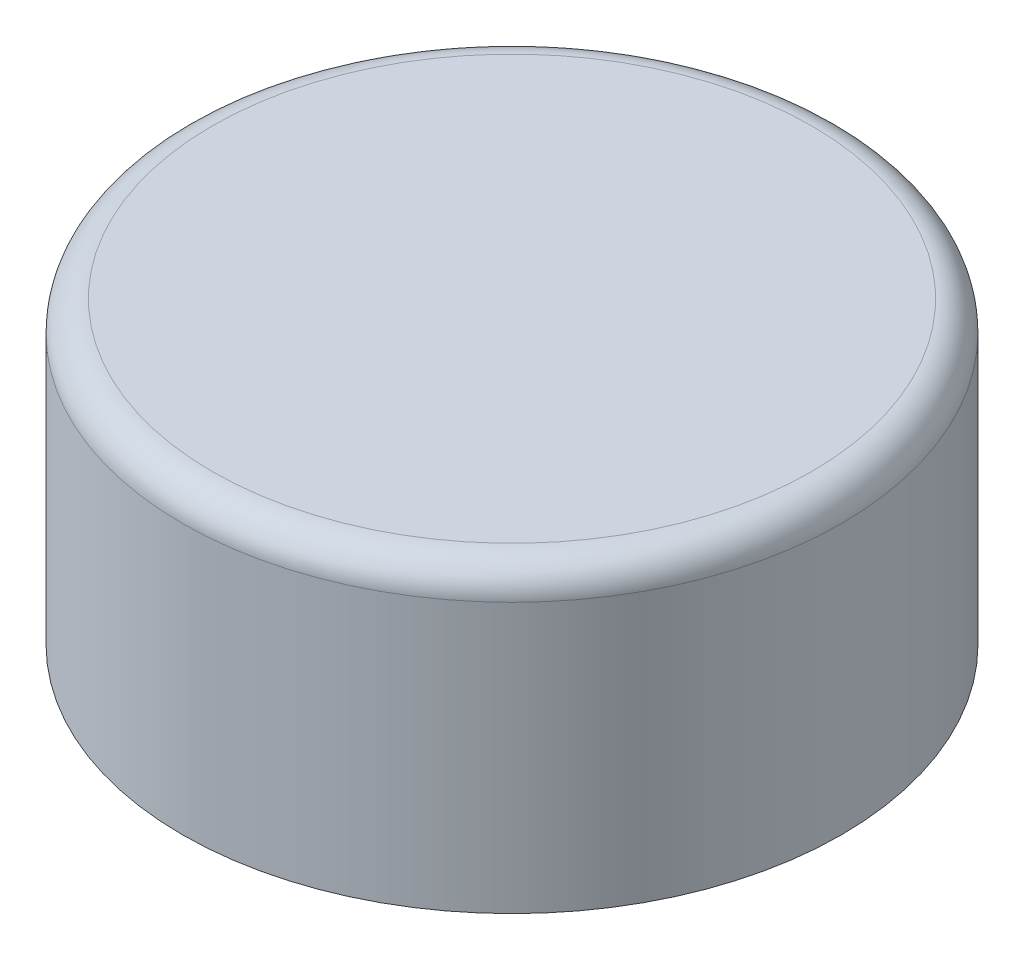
ISO-10303-21;
HEADER;
FILE_DESCRIPTION(('STEP AP214'),'2;1');
FILE_NAME('part.step','',(''),(''),'','','');
FILE_SCHEMA(('AUTOMOTIVE_DESIGN { 1 0 10303 214 1 1 1 1 }'));
ENDSEC;
DATA;
#1=APPLICATION_CONTEXT('core data for automotive mechanical design processes');
#2=APPLICATION_PROTOCOL_DEFINITION('international standard','automotive_design',2000,#1);
#3=PRODUCT_CONTEXT('',#1,'mechanical');
#4=PRODUCT('Part','Part','',(#3));
#5=PRODUCT_RELATED_PRODUCT_CATEGORY('part','',(#4));
#6=PRODUCT_DEFINITION_FORMATION('','',#4);
#7=PRODUCT_DEFINITION_CONTEXT('part definition',#1,'design');
#8=PRODUCT_DEFINITION('design','',#6,#7);
#9=PRODUCT_DEFINITION_SHAPE('','',#8);
#10=(LENGTH_UNIT() NAMED_UNIT(*) SI_UNIT(.MILLI.,.METRE.));
#11=(NAMED_UNIT(*) PLANE_ANGLE_UNIT() SI_UNIT($,.RADIAN.));
#12=(NAMED_UNIT(*) SI_UNIT($,.STERADIAN.) SOLID_ANGLE_UNIT());
#13=UNCERTAINTY_MEASURE_WITH_UNIT(LENGTH_MEASURE(1.E-05),#10,'distance_accuracy_value','');
#14=(GEOMETRIC_REPRESENTATION_CONTEXT(3) GLOBAL_UNCERTAINTY_ASSIGNED_CONTEXT((#13)) GLOBAL_UNIT_ASSIGNED_CONTEXT((#10,
#11,#12)) REPRESENTATION_CONTEXT('',''));
#15=CARTESIAN_POINT('',(0.,0.,0.));
#16=DIRECTION('',(0.,0.,1.));
#17=DIRECTION('',(1.,0.,0.));
#18=AXIS2_PLACEMENT_3D('',#15,#16,#17);
#19=CARTESIAN_POINT('',(6.66133814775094E-13,-2.22044604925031E-13,-2.22044604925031E-13));
#20=DIRECTION('',(0.,1.,0.));
#21=DIRECTION('',(0.,0.,0.999999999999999));
#22=AXIS2_PLACEMENT_3D('',#19,#20,#21);
#23=PLANE('',#22);
#24=CARTESIAN_POINT('',(6.66133814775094E-13,-2.22044604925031E-13,-2.22044604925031E-13));
#25=DIRECTION('',(0.,-1.,0.));
#26=DIRECTION('',(0.,0.,-0.999999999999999));
#27=AXIS2_PLACEMENT_3D('',#24,#25,#26);
#28=CIRCLE('',#27,13.2);
#29=CARTESIAN_POINT('',(6.66133814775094E-13,-2.23032410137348E-13,-13.2000000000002));
#30=VERTEX_POINT('',#29);
#31=EDGE_CURVE('E10',#30,#30,#28,.T.);
#32=ORIENTED_EDGE('',*,*,#31,.T.);
#33=EDGE_LOOP('',(#32));
#34=FACE_BOUND('',#33,.T.);
#35=ADVANCED_FACE('F32',(#34),#23,.F.);
#36=CARTESIAN_POINT('',(6.66133814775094E-13,-2.22044604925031E-13,-2.22044604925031E-13));
#37=DIRECTION('',(0.,-1.,0.));
#38=DIRECTION('',(0.,0.,-0.999999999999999));
#39=AXIS2_PLACEMENT_3D('',#36,#37,#38);
#40=CYLINDRICAL_SURFACE('',#39,13.2);
#41=ORIENTED_EDGE('',*,*,#31,.F.);
#42=EDGE_LOOP('',(#41));
#43=FACE_BOUND('',#42,.T.);
#44=CARTESIAN_POINT('',(6.66133814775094E-13,10.7999999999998,-1.11022302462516E-13));
#45=DIRECTION('',(0.,-1.,0.));
#46=DIRECTION('',(0.,0.,-0.999999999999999));
#47=AXIS2_PLACEMENT_3D('',#44,#45,#46);
#48=CIRCLE('',#47,13.2);
#49=CARTESIAN_POINT('',(6.66133814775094E-13,10.7999999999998,-13.2000000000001));
#50=VERTEX_POINT('',#49);
#51=EDGE_CURVE('E38',#50,#50,#48,.T.);
#52=ORIENTED_EDGE('',*,*,#51,.T.);
#53=EDGE_LOOP('',(#52));
#54=FACE_BOUND('',#53,.T.);
#55=ADVANCED_FACE('F57',(#43,#54),#40,.T.);
#56=CARTESIAN_POINT('',(6.66133814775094E-13,10.7999999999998,-1.11022302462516E-13));
#57=DIRECTION('',(0.,-1.,0.));
#58=DIRECTION('',(0.,0.,-0.999999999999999));
#59=AXIS2_PLACEMENT_3D('',#56,#57,#58);
#60=TOROIDAL_SURFACE('',#59,12.,1.2);
#61=ORIENTED_EDGE('',*,*,#51,.F.);
#62=EDGE_LOOP('',(#61));
#63=FACE_BOUND('',#62,.T.);
#64=CARTESIAN_POINT('',(2.22044604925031E-13,11.9999999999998,0.));
#65=DIRECTION('',(0.,-1.,0.));
#66=DIRECTION('',(0.,0.,-0.999999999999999));
#67=AXIS2_PLACEMENT_3D('',#64,#65,#66);
#68=CIRCLE('',#67,12.);
#69=CARTESIAN_POINT('',(2.22044604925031E-13,11.9999999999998,-12.));
#70=VERTEX_POINT('',#69);
#71=EDGE_CURVE('E42',#70,#70,#68,.T.);
#72=ORIENTED_EDGE('',*,*,#71,.T.);
#73=EDGE_LOOP('',(#72));
#74=FACE_BOUND('',#73,.T.);
#75=ADVANCED_FACE('F49',(#63,#74),#60,.T.);
#76=CARTESIAN_POINT('',(-11.9999999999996,11.9999999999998,0.));
#77=DIRECTION('',(0.,-1.,0.));
#78=DIRECTION('',(0.,0.,-0.999999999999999));
#79=AXIS2_PLACEMENT_3D('',#76,#77,#78);
#80=PLANE('',#79);
#81=ORIENTED_EDGE('',*,*,#71,.F.);
#82=EDGE_LOOP('',(#81));
#83=FACE_BOUND('',#82,.T.);
#84=ADVANCED_FACE('F51',(#83),#80,.F.);
#85=CLOSED_SHELL('',(#35,#55,#75,#84));
#86=MANIFOLD_SOLID_BREP('B2',#85);
#87=ADVANCED_BREP_SHAPE_REPRESENTATION('',(#18,#86),#14);
#88=SHAPE_DEFINITION_REPRESENTATION(#9,#87);
ENDSEC;
END-ISO-10303-21;
